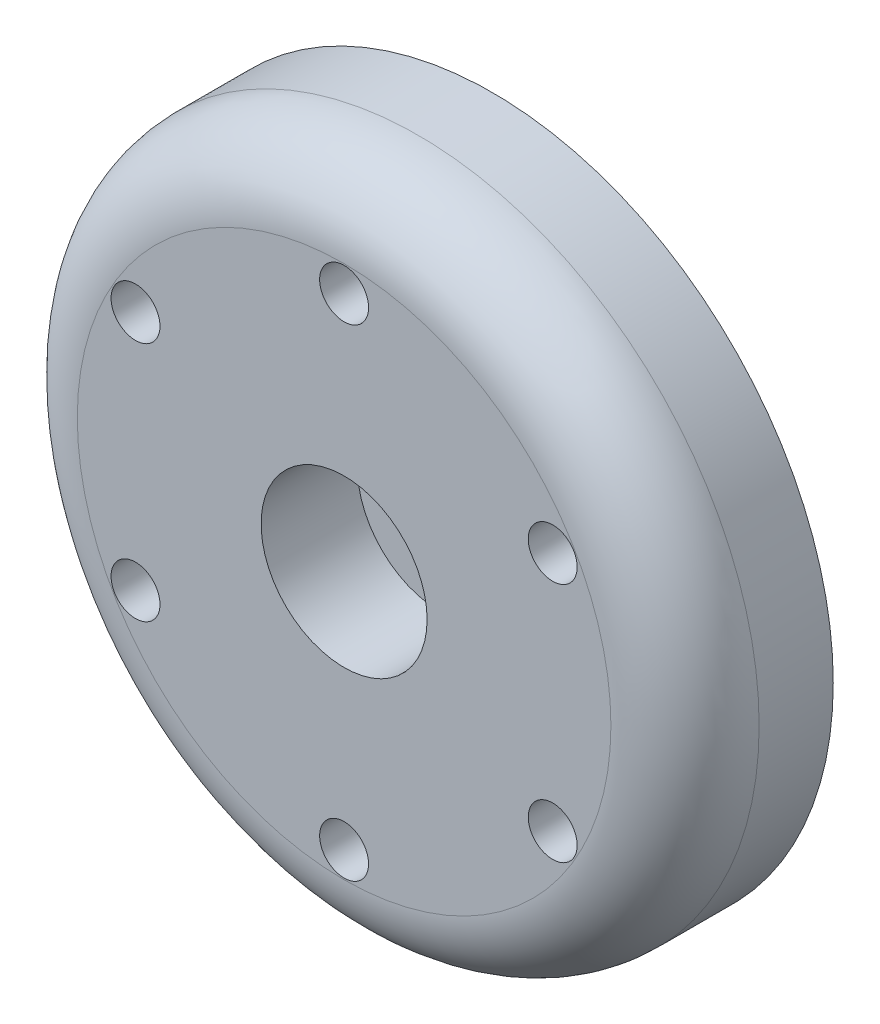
from build123d import *

# Parameters (mm, degrees)
SKETCH1_W                                           = 23
SKETCH1_H                                           = 10
HOLE1_D                                             = 40
HOLE1_DEPTH                                         = 5.8
SKETCH4_W                                           = 12.5
SKETCH4_H                                           = 5.8
F_4_CLEARANCE_HOLE1_D                               = 3.3
F_4_CLEARANCE_HOLE1_DEPTH                           = 10
CBORE_FOR_12_BINDING_HEAD_MACHINE_SCREW_D           = 6.045
CBORE_FOR_12_BINDING_HEAD_MACHINE_SCREW_CBORE_D     = 11.2
CBORE_FOR_12_BINDING_HEAD_MACHINE_SCREW_CBORE_DEPTH = 6.5
FILLET1_R                                           = 5


with BuildPart() as part:
    # Sketch1 → Revolve1 (revolve)
    with BuildSketch(Plane.XZ, mode=Mode.PRIVATE) as revolve1_sk:
        with Locations((11.5, 5)):
            Rectangle(SKETCH1_W, SKETCH1_H)
    revolve(revolve1_sk.sketch.rotate(Axis((0, 0, 10), (0, 0, -1)), 180), axis=Axis((0, 0, 10), (0, 0, -1)))

    # Hole1
    with Locations(Plane(origin=(0, 0, 0), x_dir=(-1, 0, 0), z_dir=(0, 0, -1))):
        with Locations((0, 0)):
            Hole(HOLE1_D / 2, depth=HOLE1_DEPTH)

    # Sketch4 → Revolve2 (revolve)
    with BuildSketch(Plane.XZ, mode=Mode.PRIVATE) as revolve2_sk:
        with Locations((6.25, 2.9)):
            Rectangle(SKETCH4_W, SKETCH4_H)
    revolve(revolve2_sk.sketch.rotate(Axis((0, 0, 5.8), (0, 0, -1)), 180), axis=Axis((0, 0, 5.8), (0, 0, -1)))

    # 4 Clearance Hole1
    with Locations(Plane.XY.offset(10)):
        with Locations((14.072912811, 8.125), (14.072912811, -8.125), (0, -16.25), (-14.072912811, -8.125), (-14.072912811, 8.125), (0, 16.25)):
            Hole(F_4_CLEARANCE_HOLE1_D / 2, depth=F_4_CLEARANCE_HOLE1_DEPTH)

    # CBORE for _12 Binding Head Machine Screw (through all)
    with Locations(Plane.XY.offset(10)):
        with Locations((0, 0)):
            CounterBoreHole(CBORE_FOR_12_BINDING_HEAD_MACHINE_SCREW_D / 2, CBORE_FOR_12_BINDING_HEAD_MACHINE_SCREW_CBORE_D / 2, CBORE_FOR_12_BINDING_HEAD_MACHINE_SCREW_CBORE_DEPTH)

    # Fillet1
    fillet1_edges = [part.edges().sort_by_distance(p)[0] for p in [
        (23, 0, 10),
    ]]
    fillet(fillet1_edges, radius=FILLET1_R)


solid = part.part
